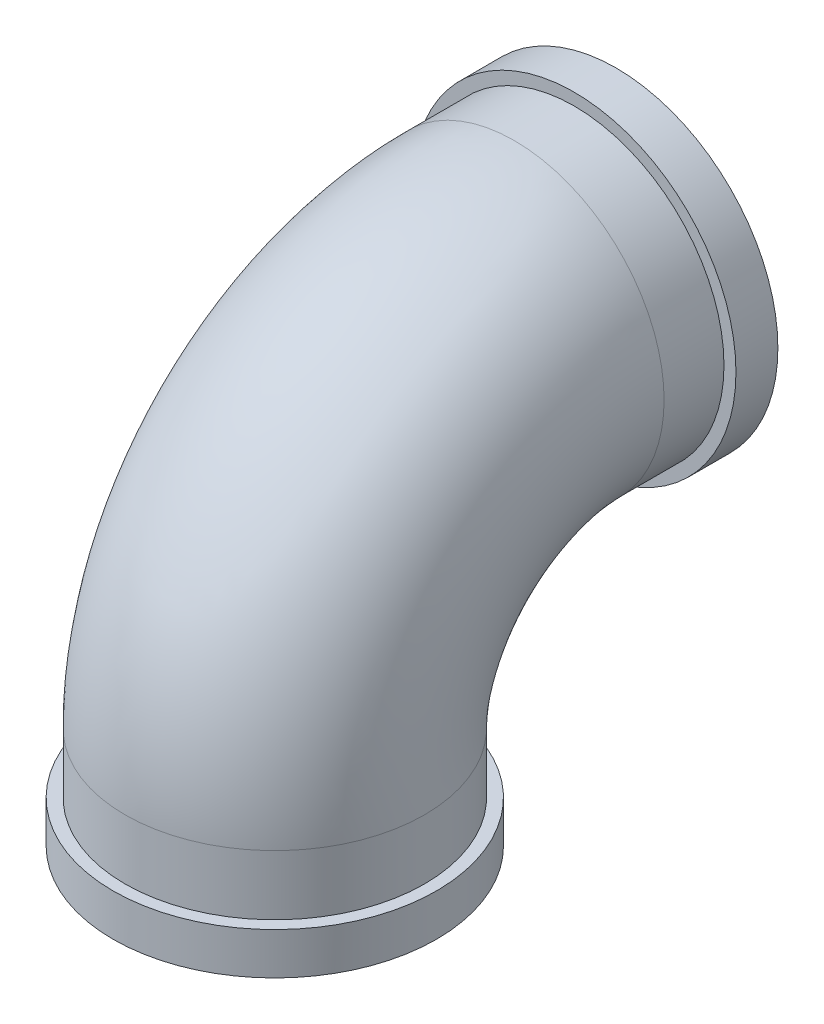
ISO-10303-21;
HEADER;
FILE_DESCRIPTION(('STEP AP214'),'2;1');
FILE_NAME('part.step','',(''),(''),'','','');
FILE_SCHEMA(('AUTOMOTIVE_DESIGN { 1 0 10303 214 1 1 1 1 }'));
ENDSEC;
DATA;
#1=APPLICATION_CONTEXT('core data for automotive mechanical design processes');
#2=APPLICATION_PROTOCOL_DEFINITION('international standard','automotive_design',2000,#1);
#3=PRODUCT_CONTEXT('',#1,'mechanical');
#4=PRODUCT('Part','Part','',(#3));
#5=PRODUCT_RELATED_PRODUCT_CATEGORY('part','',(#4));
#6=PRODUCT_DEFINITION_FORMATION('','',#4);
#7=PRODUCT_DEFINITION_CONTEXT('part definition',#1,'design');
#8=PRODUCT_DEFINITION('design','',#6,#7);
#9=PRODUCT_DEFINITION_SHAPE('','',#8);
#10=(LENGTH_UNIT() NAMED_UNIT(*) SI_UNIT(.MILLI.,.METRE.));
#11=(NAMED_UNIT(*) PLANE_ANGLE_UNIT() SI_UNIT($,.RADIAN.));
#12=(NAMED_UNIT(*) SI_UNIT($,.STERADIAN.) SOLID_ANGLE_UNIT());
#13=UNCERTAINTY_MEASURE_WITH_UNIT(LENGTH_MEASURE(1.E-05),#10,'distance_accuracy_value','');
#14=(GEOMETRIC_REPRESENTATION_CONTEXT(3) GLOBAL_UNCERTAINTY_ASSIGNED_CONTEXT((#13)) GLOBAL_UNIT_ASSIGNED_CONTEXT((#10,
#11,#12)) REPRESENTATION_CONTEXT('',''));
#15=CARTESIAN_POINT('',(0.,0.,0.));
#16=DIRECTION('',(0.,0.,1.));
#17=DIRECTION('',(1.,0.,0.));
#18=AXIS2_PLACEMENT_3D('',#15,#16,#17);
#19=CARTESIAN_POINT('',(0.,-55.,21.5));
#20=DIRECTION('',(0.,1.,0.));
#21=DIRECTION('',(0.,0.,1.));
#22=AXIS2_PLACEMENT_3D('',#19,#20,#21);
#23=CYLINDRICAL_SURFACE('',#22,13.5);
#24=CARTESIAN_POINT('',(0.,-25.,21.5));
#25=DIRECTION('',(0.,1.,0.));
#26=DIRECTION('',(0.,0.,1.));
#27=AXIS2_PLACEMENT_3D('',#24,#25,#26);
#28=CIRCLE('',#27,13.5);
#29=CARTESIAN_POINT('',(0.,-25.,35.));
#30=VERTEX_POINT('',#29);
#31=EDGE_CURVE('E49',#30,#30,#28,.T.);
#32=ORIENTED_EDGE('',*,*,#31,.F.);
#33=EDGE_LOOP('',(#32));
#34=FACE_BOUND('',#33,.T.);
#35=CARTESIAN_POINT('',(0.,-28.5,21.5));
#36=DIRECTION('',(0.,-1.,0.));
#37=DIRECTION('',(0.,0.,-1.));
#38=AXIS2_PLACEMENT_3D('',#35,#36,#37);
#39=CIRCLE('',#38,13.5);
#40=CARTESIAN_POINT('',(0.,-28.5,8.));
#41=VERTEX_POINT('',#40);
#42=EDGE_CURVE('E54',#41,#41,#39,.T.);
#43=ORIENTED_EDGE('',*,*,#42,.F.);
#44=EDGE_LOOP('',(#43));
#45=FACE_BOUND('',#44,.T.);
#46=ADVANCED_FACE('F34',(#34,#45),#23,.T.);
#47=CARTESIAN_POINT('',(0.,0.,0.));
#48=DIRECTION('',(0.,0.,1.));
#49=DIRECTION('',(1.,0.,0.));
#50=AXIS2_PLACEMENT_3D('',#47,#48,#49);
#51=CYLINDRICAL_SURFACE('',#50,12.5);
#52=CARTESIAN_POINT('',(0.,0.,1.5));
#53=DIRECTION('',(0.,0.,1.));
#54=DIRECTION('',(1.,0.,0.));
#55=AXIS2_PLACEMENT_3D('',#52,#53,#54);
#56=CIRCLE('',#55,12.5);
#57=CARTESIAN_POINT('',(0.,12.5,1.5));
#58=VERTEX_POINT('',#57);
#59=EDGE_CURVE('E45',#58,#58,#56,.T.);
#60=ORIENTED_EDGE('',*,*,#59,.F.);
#61=EDGE_LOOP('',(#60));
#62=FACE_BOUND('',#61,.T.);
#63=CARTESIAN_POINT('',(0.,0.,-3.5));
#64=DIRECTION('',(0.,0.,1.));
#65=DIRECTION('',(1.,0.,0.));
#66=AXIS2_PLACEMENT_3D('',#63,#64,#65);
#67=CIRCLE('',#66,12.5);
#68=CARTESIAN_POINT('',(12.5,0.,-3.5));
#69=VERTEX_POINT('',#68);
#70=EDGE_CURVE('E63',#69,#69,#67,.T.);
#71=ORIENTED_EDGE('',*,*,#70,.T.);
#72=EDGE_LOOP('',(#71));
#73=FACE_BOUND('',#72,.T.);
#74=ADVANCED_FACE('F67',(#62,#73),#51,.T.);
#75=CARTESIAN_POINT('',(0.,-20.,1.5));
#76=DIRECTION('',(1.,0.,0.));
#77=DIRECTION('',(0.,0.,-1.));
#78=AXIS2_PLACEMENT_3D('',#75,#76,#77);
#79=TOROIDAL_SURFACE('',#78,20.,12.5);
#80=CARTESIAN_POINT('',(0.,-20.,21.5));
#81=DIRECTION('',(0.,-1.,0.));
#82=DIRECTION('',(1.,0.,0.));
#83=AXIS2_PLACEMENT_3D('',#80,#81,#82);
#84=CIRCLE('',#83,12.5);
#85=CARTESIAN_POINT('',(0.,-20.,34.));
#86=VERTEX_POINT('',#85);
#87=EDGE_CURVE('E41',#86,#86,#84,.T.);
#88=CARTESIAN_POINT('',(0.,-20.,1.5));
#89=DIRECTION('',(1.,0.,0.));
#90=DIRECTION('',(0.,0.,-1.));
#91=AXIS2_PLACEMENT_3D('',#88,#89,#90);
#92=CIRCLE('',#91,32.5);
#93=EDGE_CURVE('',#58,#86,#92,.T.);
#94=ORIENTED_EDGE('',*,*,#59,.T.);
#95=ORIENTED_EDGE('',*,*,#87,.F.);
#96=ORIENTED_EDGE('',*,*,#93,.T.);
#97=ORIENTED_EDGE('',*,*,#93,.F.);
#98=EDGE_LOOP('',(#94,#96,#95,#97));
#99=FACE_BOUND('',#98,.T.);
#100=ADVANCED_FACE('F92',(#99),#79,.T.);
#101=CARTESIAN_POINT('',(0.,-20.,21.5));
#102=DIRECTION('',(0.,-1.,0.));
#103=DIRECTION('',(0.,0.,-1.));
#104=AXIS2_PLACEMENT_3D('',#101,#102,#103);
#105=CYLINDRICAL_SURFACE('',#104,12.5);
#106=CARTESIAN_POINT('',(0.,-25.,21.5));
#107=DIRECTION('',(0.,-1.,0.));
#108=DIRECTION('',(1.,0.,0.));
#109=AXIS2_PLACEMENT_3D('',#106,#107,#108);
#110=CIRCLE('',#109,12.5);
#111=CARTESIAN_POINT('',(12.5,-25.,21.5));
#112=VERTEX_POINT('',#111);
#113=EDGE_CURVE('E10',#112,#112,#110,.T.);
#114=ORIENTED_EDGE('',*,*,#113,.F.);
#115=EDGE_LOOP('',(#114));
#116=FACE_BOUND('',#115,.T.);
#117=ORIENTED_EDGE('',*,*,#87,.T.);
#118=EDGE_LOOP('',(#117));
#119=FACE_BOUND('',#118,.T.);
#120=ADVANCED_FACE('F88',(#116,#119),#105,.T.);
#121=CARTESIAN_POINT('',(0.,-25.,21.5));
#122=DIRECTION('',(0.,1.,0.));
#123=DIRECTION('',(0.,0.,1.));
#124=AXIS2_PLACEMENT_3D('',#121,#122,#123);
#125=PLANE('',#124);
#126=ORIENTED_EDGE('',*,*,#113,.T.);
#127=EDGE_LOOP('',(#126));
#128=FACE_BOUND('',#127,.T.);
#129=ORIENTED_EDGE('',*,*,#31,.T.);
#130=EDGE_LOOP('',(#129));
#131=FACE_BOUND('',#130,.T.);
#132=ADVANCED_FACE('F95',(#128,#131),#125,.T.);
#133=CARTESIAN_POINT('',(0.,-28.5,21.5));
#134=DIRECTION('',(0.,-1.,0.));
#135=DIRECTION('',(0.,0.,-1.));
#136=AXIS2_PLACEMENT_3D('',#133,#134,#135);
#137=PLANE('',#136);
#138=ORIENTED_EDGE('',*,*,#42,.T.);
#139=EDGE_LOOP('',(#138));
#140=FACE_BOUND('',#139,.T.);
#141=ADVANCED_FACE('F73',(#140),#137,.T.);
#142=CARTESIAN_POINT('',(0.,0.,-3.5));
#143=DIRECTION('',(0.,0.,1.));
#144=DIRECTION('',(1.,0.,0.));
#145=AXIS2_PLACEMENT_3D('',#142,#143,#144);
#146=PLANE('',#145);
#147=ORIENTED_EDGE('',*,*,#70,.F.);
#148=EDGE_LOOP('',(#147));
#149=FACE_BOUND('',#148,.T.);
#150=CARTESIAN_POINT('',(0.,0.,-3.5));
#151=DIRECTION('',(0.,0.,1.));
#152=DIRECTION('',(1.,0.,0.));
#153=AXIS2_PLACEMENT_3D('',#150,#151,#152);
#154=CIRCLE('',#153,13.5);
#155=CARTESIAN_POINT('',(13.5,0.,-3.5));
#156=VERTEX_POINT('',#155);
#157=EDGE_CURVE('E60',#156,#156,#154,.T.);
#158=ORIENTED_EDGE('',*,*,#157,.T.);
#159=EDGE_LOOP('',(#158));
#160=FACE_BOUND('',#159,.T.);
#161=ADVANCED_FACE('F69',(#149,#160),#146,.T.);
#162=CARTESIAN_POINT('',(0.,0.,-7.));
#163=DIRECTION('',(0.,0.,-1.));
#164=DIRECTION('',(-1.,0.,0.));
#165=AXIS2_PLACEMENT_3D('',#162,#163,#164);
#166=PLANE('',#165);
#167=CARTESIAN_POINT('',(0.,0.,-7.));
#168=DIRECTION('',(0.,0.,-1.));
#169=DIRECTION('',(-1.,0.,0.));
#170=AXIS2_PLACEMENT_3D('',#167,#168,#169);
#171=CIRCLE('',#170,13.5);
#172=CARTESIAN_POINT('',(-13.5,0.,-7.));
#173=VERTEX_POINT('',#172);
#174=EDGE_CURVE('E57',#173,#173,#171,.T.);
#175=ORIENTED_EDGE('',*,*,#174,.T.);
#176=EDGE_LOOP('',(#175));
#177=FACE_BOUND('',#176,.T.);
#178=ADVANCED_FACE('F72',(#177),#166,.T.);
#179=CARTESIAN_POINT('',(0.,0.,-30.));
#180=DIRECTION('',(0.,0.,1.));
#181=DIRECTION('',(1.,0.,0.));
#182=AXIS2_PLACEMENT_3D('',#179,#180,#181);
#183=CYLINDRICAL_SURFACE('',#182,13.5);
#184=ORIENTED_EDGE('',*,*,#174,.F.);
#185=EDGE_LOOP('',(#184));
#186=FACE_BOUND('',#185,.T.);
#187=ORIENTED_EDGE('',*,*,#157,.F.);
#188=EDGE_LOOP('',(#187));
#189=FACE_BOUND('',#188,.T.);
#190=ADVANCED_FACE('F36',(#186,#189),#183,.T.);
#191=CLOSED_SHELL('',(#46,#74,#100,#120,#132,#141,#161,#178,#190));
#192=MANIFOLD_SOLID_BREP('B2',#191);
#193=ADVANCED_BREP_SHAPE_REPRESENTATION('',(#18,#192),#14);
#194=SHAPE_DEFINITION_REPRESENTATION(#9,#193);
ENDSEC;
END-ISO-10303-21;
